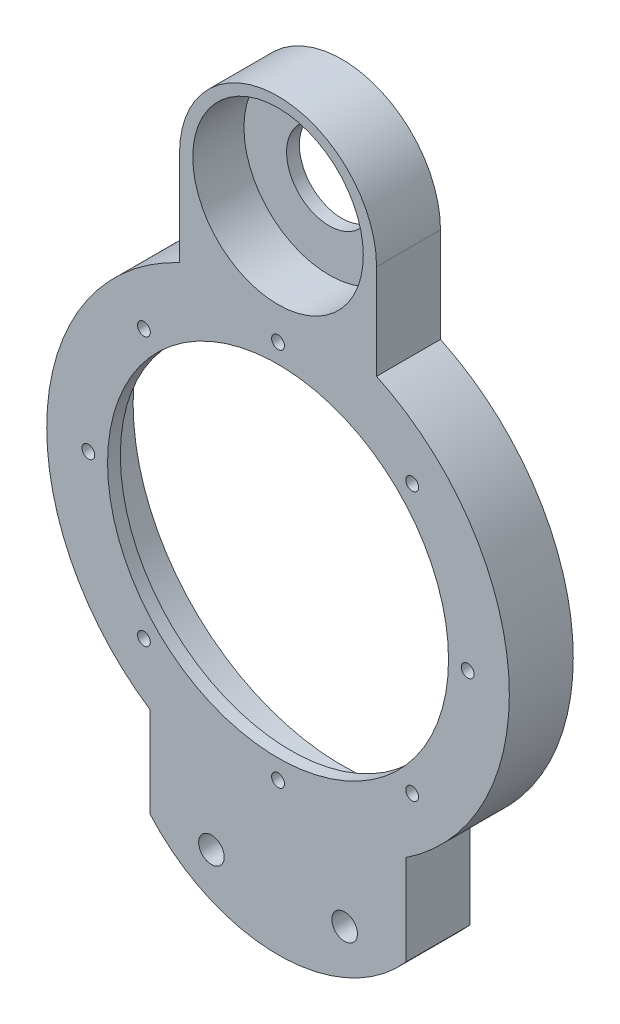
from build123d import *

# Parameters (mm, degrees)
SKETCH2_R           = 20
SKETCH2_R_2         = 3
SKETCH2_R_3         = 40
BOSS_EXTRUDE5_DEPTH = 15
SKETCH21_R          = 20
SKETCH21_R_2        = 10
BOSS_EXTRUDE6_DEPTH = 3
SKETCH22_R          = 49
CUT_EXTRUDE1_DEPTH  = 12
SKETCH23_R          = 1.5
CUT_EXTRUDE3_DEPTH  = 183.05884882


with BuildPart() as part:
    # Sketch2 → Boss-Extrude5 (new body)
    with BuildSketch(Plane.XY):
        with BuildLine():
            Line((0, 0), (0, 21.234591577))
            ThreePointArc((0, 21.234591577), (-24.124872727, 70.408561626), (6.885471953, 115.557729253))
            Line((6.885471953, 115.557729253), (6.885471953, 137.820795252))
            ThreePointArc((6.885471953, 137.820795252), (30, 160.935323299), (53.114528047, 137.820795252))
            Line((53.114528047, 137.820795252), (53.114528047, 115.557729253))
            ThreePointArc((53.114528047, 115.557729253), (84.124872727, 70.408561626), (60, 21.234591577))
            Line((60, 21.234591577), (60, 0))
            ThreePointArc((60, 0), (30, -13.542486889), (0, 0))
        make_face()
        with Locations((30, 138.577513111)):
            Circle(SKETCH2_R, mode=Mode.SUBTRACT)
        with Locations((14.375, 0)):
            Circle(SKETCH2_R_2, mode=Mode.SUBTRACT)
        with Locations(Location((45.625, 0, 0), (0, 0, 180))):
            Circle(SKETCH2_R_2, mode=Mode.SUBTRACT)
        with Locations((30, 66.457513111)):
            Circle(SKETCH2_R_3, mode=Mode.SUBTRACT)
    extrude(amount=BOSS_EXTRUDE5_DEPTH)

    # Sketch21 → Boss-Extrude6 (add)
    with BuildSketch(Plane(origin=(0, 0, 0), x_dir=(-1, 0, 0), z_dir=(0, 0, -1))):
        with Locations((-30, 138.577513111)):
            Circle(SKETCH21_R)
        with Locations((-30, 138.577513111)):
            Circle(SKETCH21_R_2, mode=Mode.SUBTRACT)
    extrude(amount=-BOSS_EXTRUDE6_DEPTH)

    # Sketch22 → Cut-Extrude1 (cut)
    with BuildSketch(Plane(origin=(0, 0, 0), x_dir=(-1, 0, 0), z_dir=(0, 0, -1))):
        with Locations((-30, 66.457513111)):
            Circle(SKETCH22_R)
    extrude(amount=-CUT_EXTRUDE1_DEPTH, mode=Mode.SUBTRACT)

    # Sketch23 → Cut-Extrude3 (cut, through all)
    with BuildSketch(Plane(origin=(0, 0, 12), x_dir=(-1, 0, 0), z_dir=(0, 0, -1))):
        with Locations((-30, 110.957513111)):
            Circle(SKETCH23_R)
        with Locations((1.466251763, 97.923764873)):
            Circle(SKETCH23_R)
        with Locations((14.5, 66.457513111)):
            Circle(SKETCH23_R)
        with Locations((1.466251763, 34.991261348)):
            Circle(SKETCH23_R)
        with Locations((-30, 21.957513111)):
            Circle(SKETCH23_R)
        with Locations((-61.466251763, 34.991261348)):
            Circle(SKETCH23_R)
        with Locations((-74.5, 66.457513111)):
            Circle(SKETCH23_R)
        with Locations((-61.466251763, 97.923764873)):
            Circle(SKETCH23_R)
    extrude(amount=-CUT_EXTRUDE3_DEPTH, mode=Mode.SUBTRACT)


solid = part.part
